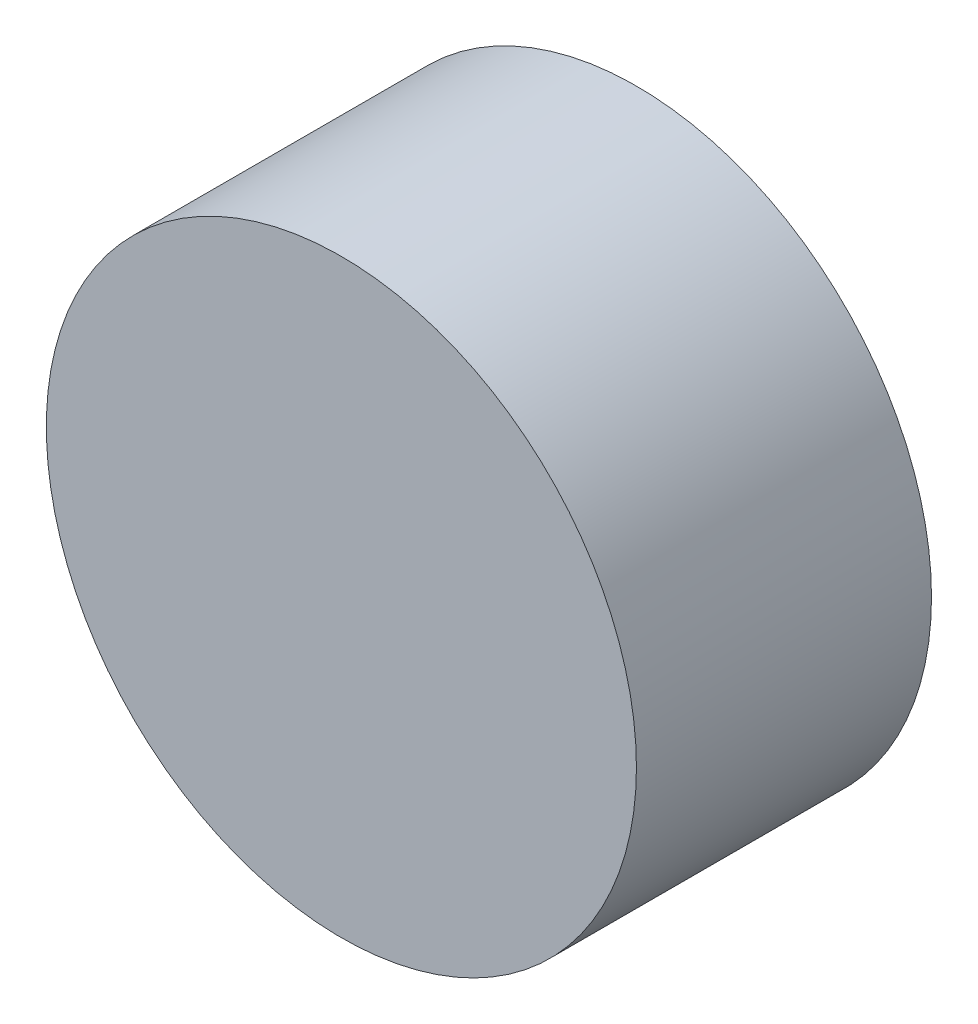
from build123d import *

# Parameters (mm, degrees)
SKIZZE1_R                       = 10
AUFSATZ_LINEAR_AUSTRAGEN1_DEPTH = 10


with BuildPart() as part:
    # Skizze1 → Aufsatz-Linear austragen1 (new body)
    with BuildSketch(Plane.XY):
        Circle(SKIZZE1_R)
    extrude(amount=AUFSATZ_LINEAR_AUSTRAGEN1_DEPTH)


solid = part.part
